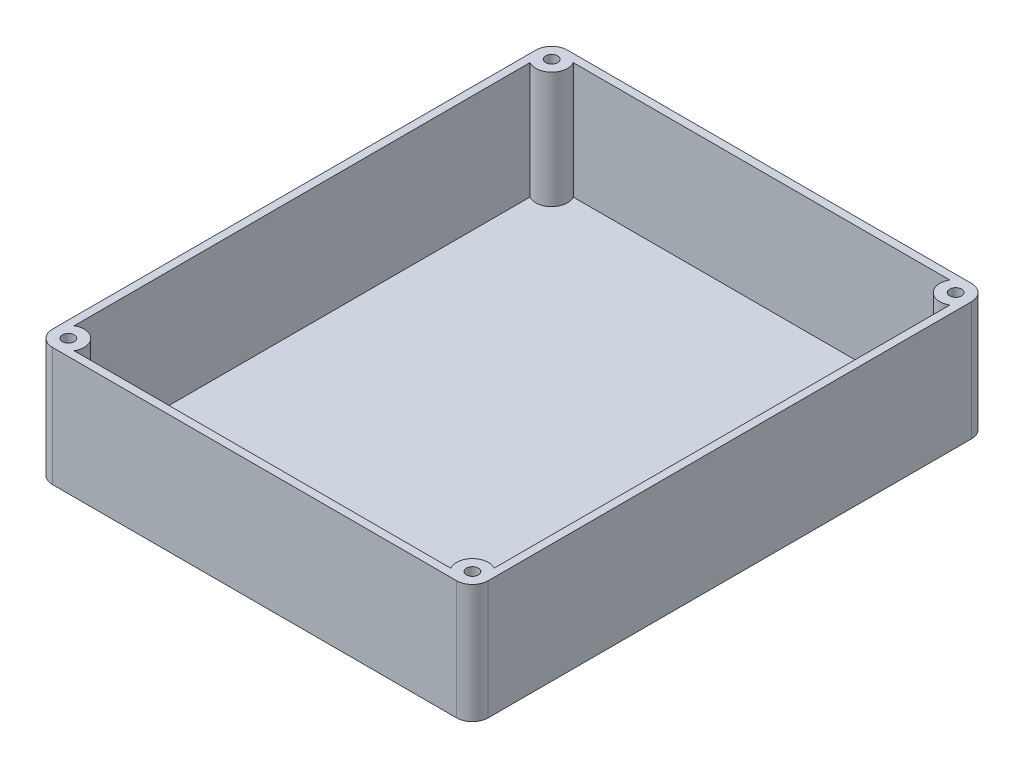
from build123d import *

# Parameters (mm, degrees)
SKETCH2_W           = 110
SKETCH2_H           = 130
SKETCH2_W_2         = 106
SKETCH2_H_2         = 126
BOSS_EXTRUDE1_DEPTH = 30
SKETCH3_W           = 110
SKETCH3_H           = 130
BOSS_EXTRUDE2_DEPTH = 0.6
FILLET3_R           = 4
SKETCH5_R           = 4
SKETCH5_R_2         = 1.5
BOSS_EXTRUDE3_DEPTH = 29.4


with BuildPart() as part:
    # Sketch2 → Boss-Extrude1 (new body)
    with BuildSketch(Plane(origin=(0, 0, 0), x_dir=(1, 0, 0), z_dir=(0, 1, 0))):
        Rectangle(SKETCH2_W, SKETCH2_H)
        Rectangle(SKETCH2_W_2, SKETCH2_H_2, mode=Mode.SUBTRACT)
    extrude(amount=BOSS_EXTRUDE1_DEPTH)

    # Sketch3 → Boss-Extrude2 (add)
    with BuildSketch(Plane.XZ):
        Rectangle(SKETCH3_W, SKETCH3_H)
    extrude(amount=-BOSS_EXTRUDE2_DEPTH)

    # Fillet3
    fillet3_edges = [part.edges().sort_by_distance(p)[0] for p in [
        (-55, 15, -65),
        (55, 15, -65),
        (55, 15, 65),
        (-55, 15, 65),
    ]]
    fillet(fillet3_edges, radius=FILLET3_R)

    # Sketch5 → Boss-Extrude3 (add)
    # profile 1 of 4: a face of its own
    with BuildSketch(Plane(origin=(0, 30, 0), x_dir=(1, 0, 0), z_dir=(0, 1, 0))):
        with Locations((-51, 61)):
            Circle(SKETCH5_R)
        with Locations(Location((-51, 61, 0), (0, 0, 270))):
            Circle(SKETCH5_R_2, mode=Mode.SUBTRACT)
    # profile 2 of 4: a face of its own
    with BuildSketch(Plane(origin=(0, 30, 0), x_dir=(1, 0, 0), z_dir=(0, 1, 0))):
        with Locations((51, 61)):
            Circle(SKETCH5_R)
        with Locations(Location((51, 61, 0), (0, 0, 270))):
            Circle(SKETCH5_R_2, mode=Mode.SUBTRACT)
    # profile 3 of 4: a face of its own
    with BuildSketch(Plane(origin=(0, 30, 0), x_dir=(1, 0, 0), z_dir=(0, 1, 0))):
        with Locations((51, -61)):
            Circle(SKETCH5_R)
        with Locations(Location((51, -61, 0), (0, 0, 270))):
            Circle(SKETCH5_R_2, mode=Mode.SUBTRACT)
    # profile 4 of 4: a face of its own
    with BuildSketch(Plane(origin=(0, 30, 0), x_dir=(1, 0, 0), z_dir=(0, 1, 0))):
        with Locations((-51, -61)):
            Circle(SKETCH5_R)
        with Locations(Location((-51, -61, 0), (0, 0, 270))):
            Circle(SKETCH5_R_2, mode=Mode.SUBTRACT)
    extrude(amount=-BOSS_EXTRUDE3_DEPTH)


solid = part.part
